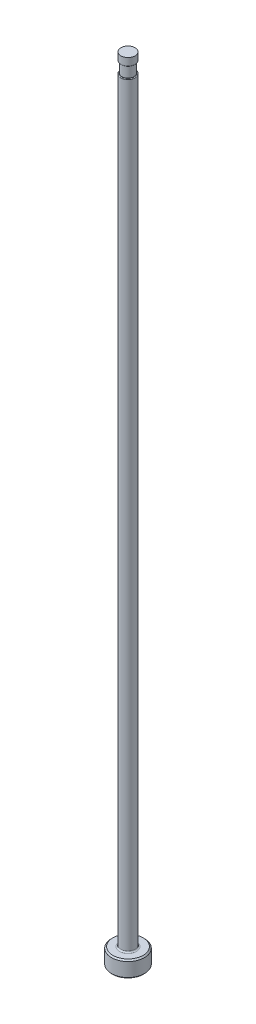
ISO-10303-21;
HEADER;
FILE_DESCRIPTION(('STEP AP214'),'2;1');
FILE_NAME('part.step','',(''),(''),'','','');
FILE_SCHEMA(('AUTOMOTIVE_DESIGN { 1 0 10303 214 1 1 1 1 }'));
ENDSEC;
DATA;
#1=APPLICATION_CONTEXT('core data for automotive mechanical design processes');
#2=APPLICATION_PROTOCOL_DEFINITION('international standard','automotive_design',2000,#1);
#3=PRODUCT_CONTEXT('',#1,'mechanical');
#4=PRODUCT('Part','Part','',(#3));
#5=PRODUCT_RELATED_PRODUCT_CATEGORY('part','',(#4));
#6=PRODUCT_DEFINITION_FORMATION('','',#4);
#7=PRODUCT_DEFINITION_CONTEXT('part definition',#1,'design');
#8=PRODUCT_DEFINITION('design','',#6,#7);
#9=PRODUCT_DEFINITION_SHAPE('','',#8);
#10=(LENGTH_UNIT() NAMED_UNIT(*) SI_UNIT(.MILLI.,.METRE.));
#11=(NAMED_UNIT(*) PLANE_ANGLE_UNIT() SI_UNIT($,.RADIAN.));
#12=(NAMED_UNIT(*) SI_UNIT($,.STERADIAN.) SOLID_ANGLE_UNIT());
#13=UNCERTAINTY_MEASURE_WITH_UNIT(LENGTH_MEASURE(1.E-05),#10,'distance_accuracy_value','');
#14=(GEOMETRIC_REPRESENTATION_CONTEXT(3) GLOBAL_UNCERTAINTY_ASSIGNED_CONTEXT((#13)) GLOBAL_UNIT_ASSIGNED_CONTEXT((#10,
#11,#12)) REPRESENTATION_CONTEXT('',''));
#15=CARTESIAN_POINT('',(0.,0.,0.));
#16=DIRECTION('',(0.,0.,1.));
#17=DIRECTION('',(1.,0.,0.));
#18=AXIS2_PLACEMENT_3D('',#15,#16,#17);
#19=CARTESIAN_POINT('',(-1.38810999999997,150.876,0.));
#20=DIRECTION('',(0.,1.,0.));
#21=DIRECTION('',(0.,0.,1.));
#22=AXIS2_PLACEMENT_3D('',#19,#20,#21);
#23=PLANE('',#22);
#24=CARTESIAN_POINT('',(0.,150.876,0.));
#25=DIRECTION('',(0.,1.,0.));
#26=DIRECTION('',(0.,0.,1.));
#27=AXIS2_PLACEMENT_3D('',#24,#25,#26);
#28=CIRCLE('',#27,1.23570999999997);
#29=CARTESIAN_POINT('',(0.,150.876,1.23570999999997));
#30=VERTEX_POINT('',#29);
#31=EDGE_CURVE('E11',#30,#30,#28,.F.);
#32=ORIENTED_EDGE('',*,*,#31,.T.);
#33=EDGE_LOOP('',(#32));
#34=FACE_BOUND('',#33,.T.);
#35=CARTESIAN_POINT('',(0.,150.876,0.));
#36=DIRECTION('',(0.,1.,0.));
#37=DIRECTION('',(0.,0.,1.));
#38=AXIS2_PLACEMENT_3D('',#35,#36,#37);
#39=CIRCLE('',#38,1.18490999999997);
#40=CARTESIAN_POINT('',(0.,150.876,1.18490999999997));
#41=VERTEX_POINT('',#40);
#42=EDGE_CURVE('E78',#41,#41,#39,.T.);
#43=ORIENTED_EDGE('',*,*,#42,.T.);
#44=EDGE_LOOP('',(#43));
#45=FACE_BOUND('',#44,.T.);
#46=ADVANCED_FACE('F36',(#34,#45),#23,.F.);
#47=CARTESIAN_POINT('',(0.,259.958771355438,0.));
#48=DIRECTION('',(0.,1.,0.));
#49=DIRECTION('',(0.,0.,1.));
#50=AXIS2_PLACEMENT_3D('',#47,#48,#49);
#51=CYLINDRICAL_SURFACE('',#50,1.38810999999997);
#52=DIRECTION('',(0.,1.,0.));
#53=VECTOR('',#52,1.);
#54=CARTESIAN_POINT('',(-1.18490999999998,259.958771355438,-0.723075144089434));
#55=LINE('',#54,#53);
#56=CARTESIAN_POINT('',(-1.18490999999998,148.717,-0.723075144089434));
#57=VERTEX_POINT('',#56);
#58=CARTESIAN_POINT('',(-1.18490999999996,86.36,-0.723075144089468));
#59=VERTEX_POINT('',#58);
#60=EDGE_CURVE('E73',#57,#59,#55,.F.);
#61=ORIENTED_EDGE('',*,*,#60,.F.);
#62=CARTESIAN_POINT('',(0.,148.717,0.));
#63=DIRECTION('',(0.,-1.,0.));
#64=DIRECTION('',(0.,0.,-1.));
#65=AXIS2_PLACEMENT_3D('',#62,#63,#64);
#66=CIRCLE('',#65,1.38810999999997);
#67=CARTESIAN_POINT('',(-1.18490999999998,148.717,0.723075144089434));
#68=VERTEX_POINT('',#67);
#69=EDGE_CURVE('E51',#57,#68,#66,.T.);
#70=ORIENTED_EDGE('',*,*,#69,.T.);
#71=DIRECTION('',(0.,1.,0.));
#72=VECTOR('',#71,1.);
#73=CARTESIAN_POINT('',(-1.18490999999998,259.958771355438,0.723075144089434));
#74=LINE('',#73,#72);
#75=CARTESIAN_POINT('',(-1.18490999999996,86.36,0.723075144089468));
#76=VERTEX_POINT('',#75);
#77=EDGE_CURVE('E84',#76,#68,#74,.T.);
#78=ORIENTED_EDGE('',*,*,#77,.F.);
#79=CARTESIAN_POINT('',(-1.18490999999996,86.36,-0.723075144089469));
#80=CARTESIAN_POINT('',(-1.18490489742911,86.3192205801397,-0.723062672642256));
#81=CARTESIAN_POINT('',(-1.18569554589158,86.2784368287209,-0.721787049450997));
#82=CARTESIAN_POINT('',(-1.18883387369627,86.1970484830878,-0.716617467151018));
#83=CARTESIAN_POINT('',(-1.1911833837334,86.1564441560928,-0.712720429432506));
#84=CARTESIAN_POINT('',(-1.19743938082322,86.0752508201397,-0.702157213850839));
#85=CARTESIAN_POINT('',(-1.20136288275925,86.0346669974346,-0.695460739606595));
#86=CARTESIAN_POINT('',(-1.21067765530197,85.9542938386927,-0.679114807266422));
#87=CARTESIAN_POINT('',(-1.2160681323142,85.9145040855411,-0.669466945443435));
#88=CARTESIAN_POINT('',(-1.23107456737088,85.8173821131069,-0.641613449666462));
#89=CARTESIAN_POINT('',(-1.24148150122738,85.7606925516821,-0.62151960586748));
#90=CARTESIAN_POINT('',(-1.26447851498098,85.6514679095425,-0.573286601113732));
#91=CARTESIAN_POINT('',(-1.27705975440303,85.5989172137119,-0.54517973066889));
#92=CARTESIAN_POINT('',(-1.299036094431,85.5156552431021,-0.48983438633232));
#93=CARTESIAN_POINT('',(-1.30819937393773,85.4832483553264,-0.465065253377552));
#94=CARTESIAN_POINT('',(-1.32626857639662,85.4226429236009,-0.410706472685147));
#95=CARTESIAN_POINT('',(-1.3351748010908,85.3944392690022,-0.381122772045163));
#96=CARTESIAN_POINT('',(-1.35001998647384,85.3492436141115,-0.323985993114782));
#97=CARTESIAN_POINT('',(-1.35618457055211,85.3311455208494,-0.297371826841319));
#98=CARTESIAN_POINT('',(-1.36726162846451,85.2993566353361,-0.24136585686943));
#99=CARTESIAN_POINT('',(-1.37217474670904,85.285663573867,-0.211975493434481));
#100=CARTESIAN_POINT('',(-1.38024868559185,85.2634660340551,-0.150740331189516));
#101=CARTESIAN_POINT('',(-1.38339384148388,85.2550078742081,-0.118876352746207));
#102=CARTESIAN_POINT('',(-1.38743875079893,85.2441704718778,-0.0539942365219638));
#103=CARTESIAN_POINT('',(-1.38834050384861,85.2417858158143,-0.020977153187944));
#104=CARTESIAN_POINT('',(-1.38781595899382,85.2431829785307,0.0402827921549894));
#105=CARTESIAN_POINT('',(-1.38669623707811,85.2461526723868,0.0685504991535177));
#106=CARTESIAN_POINT('',(-1.38282885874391,85.2565312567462,0.124136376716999));
#107=CARTESIAN_POINT('',(-1.38008112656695,85.2639403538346,0.151454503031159));
#108=CARTESIAN_POINT('',(-1.37323772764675,85.282729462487,0.20440048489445));
#109=CARTESIAN_POINT('',(-1.36914590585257,85.2940981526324,0.23003291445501));
#110=CARTESIAN_POINT('',(-1.35995546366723,85.3202451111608,0.27928349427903));
#111=CARTESIAN_POINT('',(-1.35485642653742,85.3350247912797,0.302900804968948));
#112=CARTESIAN_POINT('',(-1.34133825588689,85.3753722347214,0.358961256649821));
#113=CARTESIAN_POINT('',(-1.33251649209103,85.4026776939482,0.390059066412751));
#114=CARTESIAN_POINT('',(-1.31441262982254,85.4619257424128,0.447296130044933));
#115=CARTESIAN_POINT('',(-1.3051296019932,85.493877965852,0.473424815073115));
#116=CARTESIAN_POINT('',(-1.28282911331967,85.5759694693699,0.531562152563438));
#117=CARTESIAN_POINT('',(-1.26997193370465,85.6279111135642,0.561075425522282));
#118=CARTESIAN_POINT('',(-1.24628723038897,85.7362374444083,0.611885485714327));
#119=CARTESIAN_POINT('',(-1.23546851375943,85.7926399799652,0.633147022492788));
#120=CARTESIAN_POINT('',(-1.2193975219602,85.8914407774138,0.663412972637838));
#121=CARTESIAN_POINT('',(-1.21343915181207,85.9332026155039,0.674183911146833));
#122=CARTESIAN_POINT('',(-1.20313242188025,86.0176684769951,0.692410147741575));
#123=CARTESIAN_POINT('',(-1.19878518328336,86.0603731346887,0.69986313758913));
#124=CARTESIAN_POINT('',(-1.19185743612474,86.1458039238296,0.711598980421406));
#125=CARTESIAN_POINT('',(-1.18925556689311,86.1885231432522,0.715920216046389));
#126=CARTESIAN_POINT('',(-1.18577996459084,86.2741637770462,0.721648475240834));
#127=CARTESIAN_POINT('',(-1.18490366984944,86.3170847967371,0.723059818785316));
#128=CARTESIAN_POINT('',(-1.18490999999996,86.36,0.723075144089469));
#129=B_SPLINE_CURVE_WITH_KNOTS('',3,(#79,#80,#81,#82,#83,#84,#85,#86,#87,#88,#89,#90,#91,#92,
#93,#94,#95,#96,#97,#98,#99,#100,#101,#102,#103,#104,#105,#106,#107,#108,#109,#110,#111,#112,
#113,#114,#115,#116,#117,#118,#119,#120,#121,#122,#123,#124,#125,#126,#127,#128),.UNSPECIFIED.,
.F.,.F.,(4,2,2,2,2,2,2,2,2,2,2,2,2,2,2,2,2,2,2,2,2,2,2,2,4),(0.,0.122317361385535,
0.244778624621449,0.368600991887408,0.492356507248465,0.674882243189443,0.856682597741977,
0.981714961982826,1.10659403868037,1.20453097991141,1.30241738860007,1.40115795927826,
1.49981048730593,1.58473133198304,1.66965612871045,1.75434007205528,1.83905912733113,
1.96528739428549,2.09178120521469,2.27410969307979,2.45720871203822,2.58766049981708,
2.71820289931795,2.8471169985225,2.97583957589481),.UNSPECIFIED.);
#130=EDGE_CURVE('E81',#59,#76,#129,.T.);
#131=ORIENTED_EDGE('',*,*,#130,.F.);
#132=EDGE_LOOP('',(#61,#70,#78,#131));
#133=FACE_BOUND('',#132,.T.);
#134=CARTESIAN_POINT('',(0.,3.42900000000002,0.));
#135=DIRECTION('',(0.,1.,0.));
#136=DIRECTION('',(0.,0.,1.));
#137=AXIS2_PLACEMENT_3D('',#134,#135,#136);
#138=CIRCLE('',#137,1.38810999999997);
#139=CARTESIAN_POINT('',(0.,3.42900000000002,1.38810999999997));
#140=VERTEX_POINT('',#139);
#141=EDGE_CURVE('E116',#140,#140,#138,.T.);
#142=ORIENTED_EDGE('',*,*,#141,.T.);
#143=EDGE_LOOP('',(#142));
#144=FACE_BOUND('',#143,.T.);
#145=ADVANCED_FACE('F82',(#133,#144),#51,.T.);
#146=CARTESIAN_POINT('',(0.,0.,0.));
#147=DIRECTION('',(0.,-1.,0.));
#148=DIRECTION('',(0.,0.,-1.));
#149=AXIS2_PLACEMENT_3D('',#146,#147,#148);
#150=PLANE('',#149);
#151=CARTESIAN_POINT('',(0.,0.,0.));
#152=DIRECTION('',(0.,-1.,0.));
#153=DIRECTION('',(0.,0.,-1.));
#154=AXIS2_PLACEMENT_3D('',#151,#152,#153);
#155=CIRCLE('',#154,2.92099999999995);
#156=CARTESIAN_POINT('',(0.,0.,-2.92099999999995));
#157=VERTEX_POINT('',#156);
#158=EDGE_CURVE('E113',#157,#157,#155,.T.);
#159=ORIENTED_EDGE('',*,*,#158,.T.);
#160=EDGE_LOOP('',(#159));
#161=FACE_BOUND('',#160,.T.);
#162=ADVANCED_FACE('F192',(#161),#150,.T.);
#163=CARTESIAN_POINT('',(0.,259.958771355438,0.));
#164=DIRECTION('',(0.,1.,0.));
#165=DIRECTION('',(0.,0.,1.));
#166=AXIS2_PLACEMENT_3D('',#163,#164,#165);
#167=CYLINDRICAL_SURFACE('',#166,3.17499999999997);
#168=CARTESIAN_POINT('',(0.,2.92100000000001,0.));
#169=DIRECTION('',(0.,1.,0.));
#170=DIRECTION('',(0.,0.,1.));
#171=AXIS2_PLACEMENT_3D('',#168,#169,#170);
#172=CIRCLE('',#171,3.17499999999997);
#173=CARTESIAN_POINT('',(0.,2.92100000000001,3.17499999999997));
#174=VERTEX_POINT('',#173);
#175=EDGE_CURVE('E110',#174,#174,#172,.F.);
#176=ORIENTED_EDGE('',*,*,#175,.T.);
#177=EDGE_LOOP('',(#176));
#178=FACE_BOUND('',#177,.T.);
#179=CARTESIAN_POINT('',(0.,0.254000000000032,0.));
#180=DIRECTION('',(0.,-1.,0.));
#181=DIRECTION('',(0.,0.,-1.));
#182=AXIS2_PLACEMENT_3D('',#179,#180,#181);
#183=CIRCLE('',#182,3.17499999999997);
#184=CARTESIAN_POINT('',(0.,0.254000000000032,-3.17499999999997));
#185=VERTEX_POINT('',#184);
#186=EDGE_CURVE('E107',#185,#185,#183,.F.);
#187=ORIENTED_EDGE('',*,*,#186,.T.);
#188=EDGE_LOOP('',(#187));
#189=FACE_BOUND('',#188,.T.);
#190=ADVANCED_FACE('F195',(#178,#189),#167,.T.);
#191=CARTESIAN_POINT('',(-3.17499999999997,3.175,0.));
#192=DIRECTION('',(0.,1.,0.));
#193=DIRECTION('',(0.,0.,1.));
#194=AXIS2_PLACEMENT_3D('',#191,#192,#193);
#195=PLANE('',#194);
#196=CARTESIAN_POINT('',(0.,3.175,0.));
#197=DIRECTION('',(0.,1.,0.));
#198=DIRECTION('',(0.,0.,1.));
#199=AXIS2_PLACEMENT_3D('',#196,#197,#198);
#200=CIRCLE('',#199,1.64210999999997);
#201=CARTESIAN_POINT('',(0.,3.175,1.64210999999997));
#202=VERTEX_POINT('',#201);
#203=EDGE_CURVE('E87',#202,#202,#200,.F.);
#204=ORIENTED_EDGE('',*,*,#203,.T.);
#205=EDGE_LOOP('',(#204));
#206=FACE_BOUND('',#205,.T.);
#207=CARTESIAN_POINT('',(0.,3.175,0.));
#208=DIRECTION('',(0.,1.,0.));
#209=DIRECTION('',(0.,0.,1.));
#210=AXIS2_PLACEMENT_3D('',#207,#208,#209);
#211=CIRCLE('',#210,2.92099999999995);
#212=CARTESIAN_POINT('',(0.,3.175,2.92099999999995));
#213=VERTEX_POINT('',#212);
#214=EDGE_CURVE('E104',#213,#213,#211,.T.);
#215=ORIENTED_EDGE('',*,*,#214,.T.);
#216=EDGE_LOOP('',(#215));
#217=FACE_BOUND('',#216,.T.);
#218=ADVANCED_FACE('F190',(#206,#217),#195,.T.);
#219=CARTESIAN_POINT('',(0.,3.17499999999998,0.));
#220=DIRECTION('',(0.,-1.,0.));
#221=DIRECTION('',(0.,0.,-1.));
#222=AXIS2_PLACEMENT_3D('',#219,#220,#221);
#223=CONICAL_SURFACE('',#222,2.92099999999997,0.7853981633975);
#224=ORIENTED_EDGE('',*,*,#175,.F.);
#225=EDGE_LOOP('',(#224));
#226=FACE_BOUND('',#225,.T.);
#227=ORIENTED_EDGE('',*,*,#214,.F.);
#228=EDGE_LOOP('',(#227));
#229=FACE_BOUND('',#228,.T.);
#230=ADVANCED_FACE('F186',(#226,#229),#223,.T.);
#231=CARTESIAN_POINT('',(0.,0.254000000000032,0.));
#232=DIRECTION('',(0.,1.,0.));
#233=DIRECTION('',(0.,0.,1.));
#234=AXIS2_PLACEMENT_3D('',#231,#232,#233);
#235=CONICAL_SURFACE('',#234,3.17499999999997,0.785398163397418);
#236=ORIENTED_EDGE('',*,*,#158,.F.);
#237=EDGE_LOOP('',(#236));
#238=FACE_BOUND('',#237,.T.);
#239=ORIENTED_EDGE('',*,*,#186,.F.);
#240=EDGE_LOOP('',(#239));
#241=FACE_BOUND('',#240,.T.);
#242=ADVANCED_FACE('F182',(#238,#241),#235,.T.);
#243=CARTESIAN_POINT('',(0.,3.42900000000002,0.));
#244=DIRECTION('',(0.,1.,0.));
#245=DIRECTION('',(0.,0.,1.));
#246=AXIS2_PLACEMENT_3D('',#243,#244,#245);
#247=TOROIDAL_SURFACE('',#246,1.64210999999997,0.254);
#248=ORIENTED_EDGE('',*,*,#203,.F.);
#249=EDGE_LOOP('',(#248));
#250=FACE_BOUND('',#249,.T.);
#251=ORIENTED_EDGE('',*,*,#141,.F.);
#252=EDGE_LOOP('',(#251));
#253=FACE_BOUND('',#252,.T.);
#254=ADVANCED_FACE('F147',(#250,#253),#247,.F.);
#255=CARTESIAN_POINT('',(-1.38810999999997,148.844,0.));
#256=DIRECTION('',(0.,-1.,0.));
#257=DIRECTION('',(0.,0.,-1.));
#258=AXIS2_PLACEMENT_3D('',#255,#256,#257);
#259=PLANE('',#258);
#260=DIRECTION('',(0.,0.,1.));
#261=VECTOR('',#260,1.);
#262=CARTESIAN_POINT('',(-1.18490999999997,148.844,0.));
#263=LINE('',#262,#261);
#264=CARTESIAN_POINT('',(-1.18490999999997,148.844,0.));
#265=VERTEX_POINT('',#264);
#266=CARTESIAN_POINT('',(-1.18490999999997,148.844,0.431725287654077));
#267=VERTEX_POINT('',#266);
#268=EDGE_CURVE('E90',#265,#267,#263,.T.);
#269=ORIENTED_EDGE('',*,*,#268,.T.);
#270=CARTESIAN_POINT('',(0.,148.844,0.));
#271=DIRECTION('',(0.,-1.,0.));
#272=DIRECTION('',(0.,0.,-1.));
#273=AXIS2_PLACEMENT_3D('',#270,#271,#272);
#274=CIRCLE('',#273,1.26110999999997);
#275=CARTESIAN_POINT('',(-1.18490999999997,148.844,-0.431725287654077));
#276=VERTEX_POINT('',#275);
#277=EDGE_CURVE('E86',#267,#276,#274,.F.);
#278=ORIENTED_EDGE('',*,*,#277,.T.);
#279=EDGE_CURVE('E79',#276,#265,#263,.T.);
#280=ORIENTED_EDGE('',*,*,#279,.T.);
#281=CARTESIAN_POINT('',(0.,148.844,0.));
#282=DIRECTION('',(0.,1.,0.));
#283=DIRECTION('',(0.,0.,1.));
#284=AXIS2_PLACEMENT_3D('',#281,#282,#283);
#285=CIRCLE('',#284,1.18490999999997);
#286=EDGE_CURVE('E101',#265,#265,#285,.T.);
#287=ORIENTED_EDGE('',*,*,#286,.F.);
#288=EDGE_LOOP('',(#269,#278,#280,#287));
#289=FACE_BOUND('',#288,.T.);
#290=ADVANCED_FACE('F144',(#289),#259,.F.);
#291=CARTESIAN_POINT('',(0.,153.448281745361,0.));
#292=DIRECTION('',(0.,1.,0.));
#293=DIRECTION('',(0.,0.,1.));
#294=AXIS2_PLACEMENT_3D('',#291,#292,#293);
#295=CYLINDRICAL_SURFACE('',#294,1.18490999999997);
#296=ORIENTED_EDGE('',*,*,#42,.F.);
#297=EDGE_LOOP('',(#296));
#298=FACE_BOUND('',#297,.T.);
#299=ORIENTED_EDGE('',*,*,#286,.T.);
#300=EDGE_LOOP('',(#299));
#301=FACE_BOUND('',#300,.T.);
#302=ADVANCED_FACE('F141',(#298,#301),#295,.T.);
#303=CARTESIAN_POINT('',(-1.18490999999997,149.86,-3.17499999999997));
#304=DIRECTION('',(1.,0.,0.));
#305=DIRECTION('',(0.,1.,0.));
#306=AXIS2_PLACEMENT_3D('',#303,#304,#305);
#307=PLANE('',#306);
#308=ORIENTED_EDGE('',*,*,#279,.F.);
#309=CARTESIAN_POINT('',(-1.18490999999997,148.844,-0.431725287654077));
#310=CARTESIAN_POINT('',(-1.18490999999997,148.843996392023,-0.443927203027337));
#311=CARTESIAN_POINT('',(-1.18490999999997,148.843793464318,-0.456134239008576));
#312=CARTESIAN_POINT('',(-1.18490999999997,148.842871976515,-0.480559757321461));
#313=CARTESIAN_POINT('',(-1.18490999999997,148.842152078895,-0.492778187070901));
#314=CARTESIAN_POINT('',(-1.18490999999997,148.840068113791,-0.51728578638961));
#315=CARTESIAN_POINT('',(-1.18490999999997,148.838697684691,-0.529574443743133));
#316=CARTESIAN_POINT('',(-1.18490999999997,148.835154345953,-0.554026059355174));
#317=CARTESIAN_POINT('',(-1.18490999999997,148.832982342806,-0.566189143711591));
#318=CARTESIAN_POINT('',(-1.18490999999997,148.82785310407,-0.589290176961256));
#319=CARTESIAN_POINT('',(-1.18490999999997,148.824976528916,-0.600245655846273));
#320=CARTESIAN_POINT('',(-1.18490999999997,148.818158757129,-0.621829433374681));
#321=CARTESIAN_POINT('',(-1.18490999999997,148.81421796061,-0.632457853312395));
#322=CARTESIAN_POINT('',(-1.18490999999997,148.805651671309,-0.651596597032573));
#323=CARTESIAN_POINT('',(-1.18490999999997,148.801211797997,-0.660188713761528));
#324=CARTESIAN_POINT('',(-1.18490999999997,148.791086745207,-0.676609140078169));
#325=CARTESIAN_POINT('',(-1.18490999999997,148.785405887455,-0.6844399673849));
#326=CARTESIAN_POINT('',(-1.18490999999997,148.775548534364,-0.695366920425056));
#327=CARTESIAN_POINT('',(-1.18490999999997,148.771921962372,-0.698957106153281));
#328=CARTESIAN_POINT('',(-1.18490999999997,148.764202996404,-0.705604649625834));
#329=CARTESIAN_POINT('',(-1.18490999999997,148.760110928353,-0.708662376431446));
#330=CARTESIAN_POINT('',(-1.18490999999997,148.752145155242,-0.71362633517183));
#331=CARTESIAN_POINT('',(-1.18490999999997,148.748337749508,-0.715637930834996));
#332=CARTESIAN_POINT('',(-1.18490999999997,148.740445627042,-0.719002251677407));
#333=CARTESIAN_POINT('',(-1.18490999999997,148.736361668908,-0.720356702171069));
#334=CARTESIAN_POINT('',(-1.18490999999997,148.729704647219,-0.721899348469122));
#335=CARTESIAN_POINT('',(-1.18490999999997,148.72718800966,-0.722337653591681));
#336=CARTESIAN_POINT('',(-1.18490999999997,148.722115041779,-0.722926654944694));
#337=CARTESIAN_POINT('',(-1.18490999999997,148.71955862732,-0.723076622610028));
#338=CARTESIAN_POINT('',(-1.18490999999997,148.717000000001,-0.723075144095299));
#339=B_SPLINE_CURVE_WITH_KNOTS('',3,(#309,#310,#311,#312,#313,#314,#315,#316,#317,#318,#319,
#320,#321,#322,#323,#324,#325,#326,#327,#328,#329,#330,#331,#332,#333,#334,#335,#336,#337,#338),
.UNSPECIFIED.,.F.,.F.,(4,2,2,2,2,2,2,2,2,2,2,2,2,2,4),(0.,0.0366119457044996,0.0733189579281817,
0.110392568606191,0.14742438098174,0.181365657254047,0.215294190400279,0.244238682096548,
0.273083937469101,0.288356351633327,0.303618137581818,0.316487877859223,0.329323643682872,
0.336971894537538,0.34463944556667),.UNSPECIFIED.);
#340=EDGE_CURVE('E59',#276,#57,#339,.T.);
#341=ORIENTED_EDGE('',*,*,#340,.T.);
#342=ORIENTED_EDGE('',*,*,#60,.T.);
#343=DIRECTION('',(0.,0.,1.));
#344=VECTOR('',#343,1.);
#345=CARTESIAN_POINT('',(-1.18490999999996,86.36,-3.17499999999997));
#346=LINE('',#345,#344);
#347=EDGE_CURVE('E77',#59,#76,#346,.T.);
#348=ORIENTED_EDGE('',*,*,#347,.T.);
#349=ORIENTED_EDGE('',*,*,#77,.T.);
#350=CARTESIAN_POINT('',(-1.18490999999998,148.717,0.723075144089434));
#351=CARTESIAN_POINT('',(-1.18490999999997,148.720961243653,0.723084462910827));
#352=CARTESIAN_POINT('',(-1.18490999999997,148.724912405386,0.72271992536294));
#353=CARTESIAN_POINT('',(-1.18490999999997,148.732661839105,0.721324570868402));
#354=CARTESIAN_POINT('',(-1.18490999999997,148.736461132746,0.720299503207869));
#355=CARTESIAN_POINT('',(-1.18490999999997,148.743834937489,0.717665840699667));
#356=CARTESIAN_POINT('',(-1.18490999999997,148.747410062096,0.716058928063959));
#357=CARTESIAN_POINT('',(-1.18490999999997,148.754307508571,0.712363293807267));
#358=CARTESIAN_POINT('',(-1.18490999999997,148.757629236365,0.710273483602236));
#359=CARTESIAN_POINT('',(-1.18490999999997,148.766123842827,0.704186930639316));
#360=CARTESIAN_POINT('',(-1.18490999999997,148.771051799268,0.699848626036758));
#361=CARTESIAN_POINT('',(-1.18490999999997,148.780179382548,0.69046605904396));
#362=CARTESIAN_POINT('',(-1.18490999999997,148.784376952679,0.685419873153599));
#363=CARTESIAN_POINT('',(-1.18490999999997,148.794925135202,0.671062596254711));
#364=CARTESIAN_POINT('',(-1.18490999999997,148.80065072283,0.661296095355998));
#365=CARTESIAN_POINT('',(-1.18490999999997,148.81064686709,0.641058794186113));
#366=CARTESIAN_POINT('',(-1.18490999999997,148.814913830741,0.630586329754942));
#367=CARTESIAN_POINT('',(-1.18490999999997,148.826249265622,0.597997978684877));
#368=CARTESIAN_POINT('',(-1.18490999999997,148.831516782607,0.575266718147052));
#369=CARTESIAN_POINT('',(-1.18490999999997,148.839081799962,0.529347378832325));
#370=CARTESIAN_POINT('',(-1.18490999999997,148.841370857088,0.506158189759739));
#371=CARTESIAN_POINT('',(-1.18490999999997,148.843127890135,0.474376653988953));
#372=CARTESIAN_POINT('',(-1.18490999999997,148.843464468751,0.465824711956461));
#373=CARTESIAN_POINT('',(-1.18490999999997,148.843899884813,0.448756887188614));
#374=CARTESIAN_POINT('',(-1.18490999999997,148.843999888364,0.440241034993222));
#375=CARTESIAN_POINT('',(-1.18490999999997,148.844,0.431725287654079));
#376=B_SPLINE_CURVE_WITH_KNOTS('',3,(#350,#351,#352,#353,#354,#355,#356,#357,#358,#359,#360,
#361,#362,#363,#364,#365,#366,#367,#368,#369,#370,#371,#372,#373,#374,#375),.UNSPECIFIED.,.F.,
.F.,(4,2,2,2,2,2,2,2,2,2,2,2,4),(0.,0.0118509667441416,0.0236001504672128,0.0353156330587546,
0.0470577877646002,0.0666403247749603,0.086277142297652,0.120048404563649,0.153902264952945,
0.223511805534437,0.293318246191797,0.31899141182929,0.344537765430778),.UNSPECIFIED.);
#377=EDGE_CURVE('E172',#68,#267,#376,.T.);
#378=ORIENTED_EDGE('',*,*,#377,.T.);
#379=ORIENTED_EDGE('',*,*,#268,.F.);
#380=EDGE_LOOP('',(#308,#341,#342,#348,#349,#378,#379));
#381=FACE_BOUND('',#380,.T.);
#382=ADVANCED_FACE('F75',(#381),#307,.F.);
#383=CARTESIAN_POINT('',(-4.35990999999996,86.36,-3.17499999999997));
#384=DIRECTION('',(0.,0.,1.));
#385=DIRECTION('',(1.,0.,0.));
#386=AXIS2_PLACEMENT_3D('',#383,#384,#385);
#387=CYLINDRICAL_SURFACE('',#386,3.175);
#388=ORIENTED_EDGE('',*,*,#347,.F.);
#389=ORIENTED_EDGE('',*,*,#130,.T.);
#390=EDGE_LOOP('',(#388,#389));
#391=FACE_BOUND('',#390,.T.);
#392=ADVANCED_FACE('F89',(#391),#387,.F.);
#393=CARTESIAN_POINT('',(0.,152.687735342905,0.));
#394=DIRECTION('',(0.,1.,0.));
#395=DIRECTION('',(0.,0.,1.));
#396=AXIS2_PLACEMENT_3D('',#393,#394,#395);
#397=CYLINDRICAL_SURFACE('',#396,1.36270999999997);
#398=CARTESIAN_POINT('',(0.,151.003,0.));
#399=DIRECTION('',(0.,1.,0.));
#400=DIRECTION('',(0.,0.,1.));
#401=AXIS2_PLACEMENT_3D('',#398,#399,#400);
#402=CIRCLE('',#401,1.36270999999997);
#403=CARTESIAN_POINT('',(0.,151.003,1.36270999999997));
#404=VERTEX_POINT('',#403);
#405=EDGE_CURVE('E44',#404,#404,#402,.T.);
#406=ORIENTED_EDGE('',*,*,#405,.T.);
#407=EDGE_LOOP('',(#406));
#408=FACE_BOUND('',#407,.T.);
#409=CARTESIAN_POINT('',(0.,152.4,0.));
#410=DIRECTION('',(0.,1.,0.));
#411=DIRECTION('',(0.,0.,1.));
#412=AXIS2_PLACEMENT_3D('',#409,#410,#411);
#413=CIRCLE('',#412,1.36270999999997);
#414=CARTESIAN_POINT('',(0.,152.4,1.36270999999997));
#415=VERTEX_POINT('',#414);
#416=EDGE_CURVE('E91',#415,#415,#413,.T.);
#417=ORIENTED_EDGE('',*,*,#416,.F.);
#418=EDGE_LOOP('',(#417));
#419=FACE_BOUND('',#418,.T.);
#420=ADVANCED_FACE('F135',(#408,#419),#397,.T.);
#421=CARTESIAN_POINT('',(-1.38810999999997,152.4,0.));
#422=DIRECTION('',(0.,1.,0.));
#423=DIRECTION('',(0.,0.,1.));
#424=AXIS2_PLACEMENT_3D('',#421,#422,#423);
#425=PLANE('',#424);
#426=ORIENTED_EDGE('',*,*,#416,.T.);
#427=EDGE_LOOP('',(#426));
#428=FACE_BOUND('',#427,.T.);
#429=ADVANCED_FACE('F149',(#428),#425,.T.);
#430=CARTESIAN_POINT('',(0.,148.717,0.));
#431=DIRECTION('',(0.,-1.,0.));
#432=DIRECTION('',(0.,0.,-1.));
#433=AXIS2_PLACEMENT_3D('',#430,#431,#432);
#434=TOROIDAL_SURFACE('',#433,1.26110999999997,0.127);
#435=ORIENTED_EDGE('',*,*,#377,.F.);
#436=ORIENTED_EDGE('',*,*,#69,.F.);
#437=ORIENTED_EDGE('',*,*,#340,.F.);
#438=ORIENTED_EDGE('',*,*,#277,.F.);
#439=EDGE_LOOP('',(#435,#436,#437,#438));
#440=FACE_BOUND('',#439,.T.);
#441=ADVANCED_FACE('F151',(#440),#434,.T.);
#442=CARTESIAN_POINT('',(0.,151.003,0.));
#443=DIRECTION('',(0.,1.,0.));
#444=DIRECTION('',(0.,0.,1.));
#445=AXIS2_PLACEMENT_3D('',#442,#443,#444);
#446=TOROIDAL_SURFACE('',#445,1.23570999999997,0.127);
#447=ORIENTED_EDGE('',*,*,#31,.F.);
#448=EDGE_LOOP('',(#447));
#449=FACE_BOUND('',#448,.T.);
#450=ORIENTED_EDGE('',*,*,#405,.F.);
#451=EDGE_LOOP('',(#450));
#452=FACE_BOUND('',#451,.T.);
#453=ADVANCED_FACE('F38',(#449,#452),#446,.T.);
#454=CLOSED_SHELL('',(#46,#145,#162,#190,#218,#230,#242,#254,#290,#302,#382,#392,#420,#429,#441,#453));
#455=MANIFOLD_SOLID_BREP('B2',#454);
#456=ADVANCED_BREP_SHAPE_REPRESENTATION('',(#18,#455),#14);
#457=SHAPE_DEFINITION_REPRESENTATION(#9,#456);
ENDSEC;
END-ISO-10303-21;
